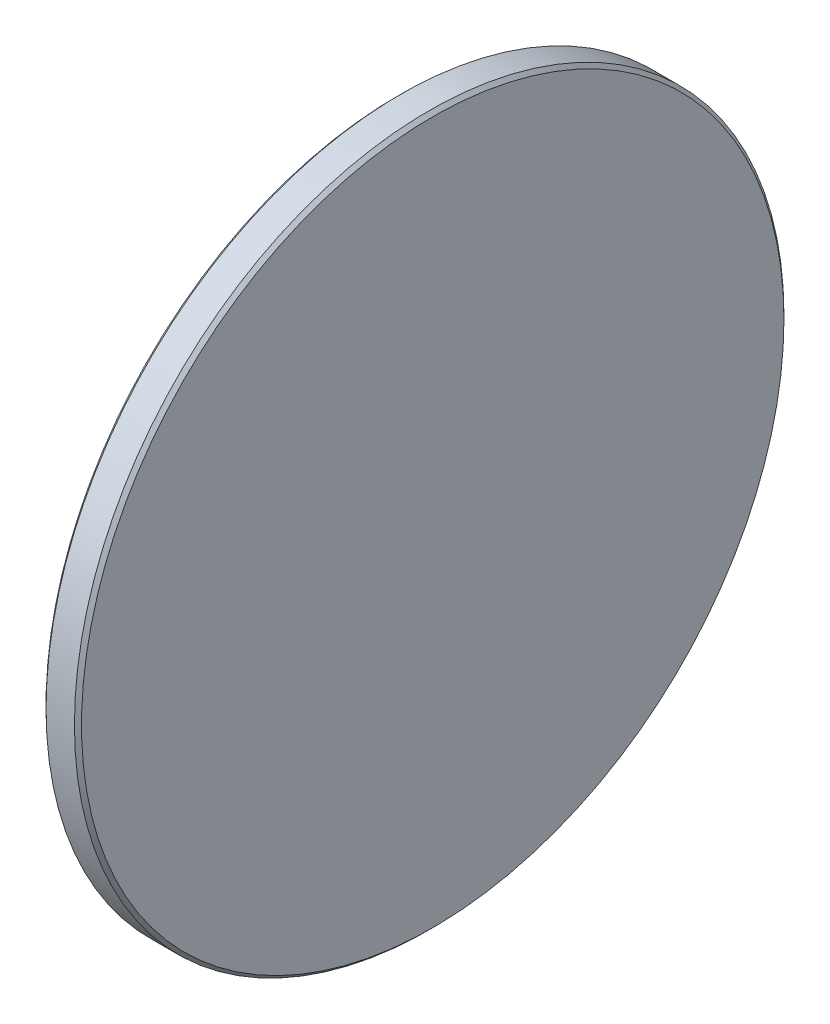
from build123d import *

# Parameters (mm, degrees)
SKETCH1_R           = 127
BOSS_EXTRUDE1_DEPTH = 12.7
CHAMFER1_SIZE       = 1.27


with BuildPart() as part:
    # Sketch1 → Boss-Extrude1 (new body)
    with BuildSketch(Plane(origin=(0, 0, 0), x_dir=(0, 0, -1), z_dir=(1, 0, 0))):
        Circle(SKETCH1_R)
    extrude(amount=BOSS_EXTRUDE1_DEPTH)

    # Chamfer1
    chamfer1_edges = [part.edges().sort_by_distance(p)[0] for p in [
        (0, 0, 127),
        (12.7, 0, 127),
    ]]
    chamfer(chamfer1_edges, length=CHAMFER1_SIZE)


solid = part.part
